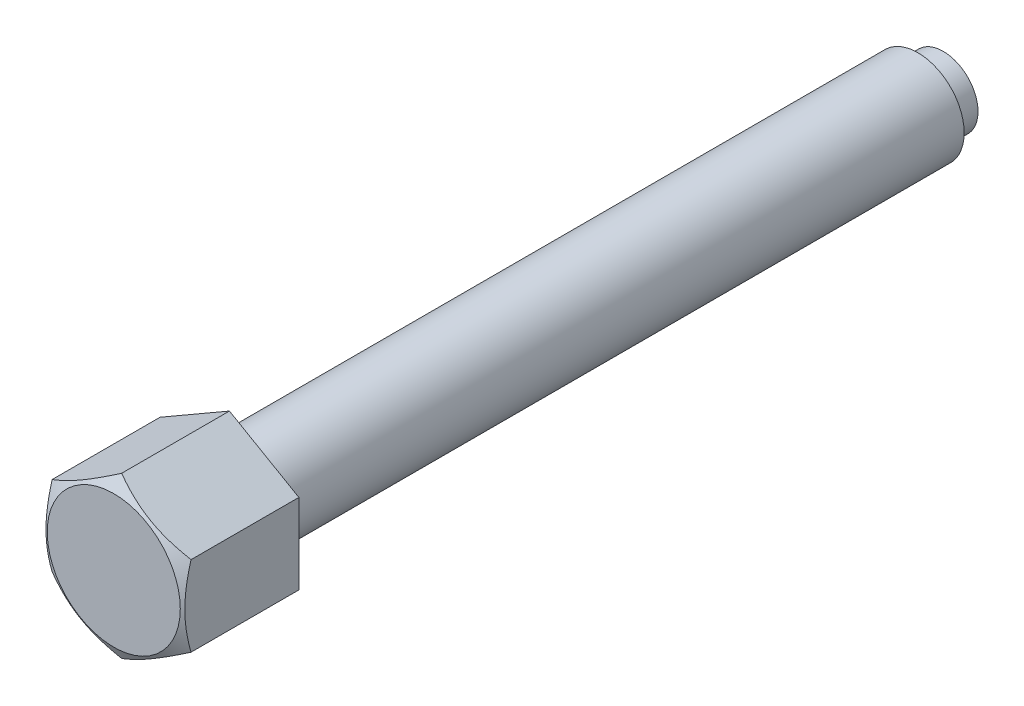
ISO-10303-21;
HEADER;
FILE_DESCRIPTION(('STEP AP214'),'2;1');
FILE_NAME('part.step','',(''),(''),'','','');
FILE_SCHEMA(('AUTOMOTIVE_DESIGN { 1 0 10303 214 1 1 1 1 }'));
ENDSEC;
DATA;
#1=APPLICATION_CONTEXT('core data for automotive mechanical design processes');
#2=APPLICATION_PROTOCOL_DEFINITION('international standard','automotive_design',2000,#1);
#3=PRODUCT_CONTEXT('',#1,'mechanical');
#4=PRODUCT('Part','Part','',(#3));
#5=PRODUCT_RELATED_PRODUCT_CATEGORY('part','',(#4));
#6=PRODUCT_DEFINITION_FORMATION('','',#4);
#7=PRODUCT_DEFINITION_CONTEXT('part definition',#1,'design');
#8=PRODUCT_DEFINITION('design','',#6,#7);
#9=PRODUCT_DEFINITION_SHAPE('','',#8);
#10=(LENGTH_UNIT() NAMED_UNIT(*) SI_UNIT(.MILLI.,.METRE.));
#11=(NAMED_UNIT(*) PLANE_ANGLE_UNIT() SI_UNIT($,.RADIAN.));
#12=(NAMED_UNIT(*) SI_UNIT($,.STERADIAN.) SOLID_ANGLE_UNIT());
#13=UNCERTAINTY_MEASURE_WITH_UNIT(LENGTH_MEASURE(1.E-05),#10,'distance_accuracy_value','');
#14=(GEOMETRIC_REPRESENTATION_CONTEXT(3) GLOBAL_UNCERTAINTY_ASSIGNED_CONTEXT((#13)) GLOBAL_UNIT_ASSIGNED_CONTEXT((#10,
#11,#12)) REPRESENTATION_CONTEXT('',''));
#15=CARTESIAN_POINT('',(0.,0.,0.));
#16=DIRECTION('',(0.,0.,1.));
#17=DIRECTION('',(1.,0.,0.));
#18=AXIS2_PLACEMENT_3D('',#15,#16,#17);
#19=CARTESIAN_POINT('',(0.,13.856406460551,125.));
#20=DIRECTION('',(-0.5,-0.86602540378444,0.));
#21=DIRECTION('',(0.86602540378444,-0.5,0.));
#22=AXIS2_PLACEMENT_3D('',#19,#20,#21);
#23=PLANE('',#22);
#24=CARTESIAN_POINT('',(12.0002,6.92808776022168,143.639461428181));
#25=CARTESIAN_POINT('',(11.7364142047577,7.08038456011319,143.727375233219));
#26=CARTESIAN_POINT('',(11.4716448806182,7.23324920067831,143.811298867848));
#27=CARTESIAN_POINT('',(10.9399829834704,7.54020434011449,143.970058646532));
#28=CARTESIAN_POINT('',(10.6730897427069,7.69429522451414,144.044891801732));
#29=CARTESIAN_POINT('',(9.86810959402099,8.15905073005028,144.254307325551));
#30=CARTESIAN_POINT('',(9.3268449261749,8.47155003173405,144.373421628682));
#31=CARTESIAN_POINT('',(8.51686717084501,8.93919090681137,144.513093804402));
#32=CARTESIAN_POINT('',(8.25057389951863,9.09293539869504,144.552881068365));
#33=CARTESIAN_POINT('',(7.71675440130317,9.40113622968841,144.619601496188));
#34=CARTESIAN_POINT('',(7.44922815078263,9.55559258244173,144.646534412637));
#35=CARTESIAN_POINT('',(6.91372963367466,9.86476279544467,144.686856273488));
#36=CARTESIAN_POINT('',(6.64575827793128,10.0194761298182,144.700261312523));
#37=CARTESIAN_POINT('',(6.10956726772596,10.3290461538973,144.713241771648));
#38=CARTESIAN_POINT('',(5.84134762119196,10.4839028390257,144.712817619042));
#39=CARTESIAN_POINT('',(5.33991062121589,10.7734076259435,144.699104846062));
#40=CARTESIAN_POINT('',(5.10665750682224,10.908076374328,144.687488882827));
#41=CARTESIAN_POINT('',(4.64068775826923,11.1771041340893,144.654016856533));
#42=CARTESIAN_POINT('',(4.40797116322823,11.3114631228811,144.632160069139));
#43=CARTESIAN_POINT('',(3.94320092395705,11.5797983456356,144.578587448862));
#44=CARTESIAN_POINT('',(3.711147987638,11.7137741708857,144.546863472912));
#45=CARTESIAN_POINT('',(3.24813003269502,11.9810977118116,144.474113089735));
#46=CARTESIAN_POINT('',(3.01716508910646,12.1144453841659,144.433086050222));
#47=CARTESIAN_POINT('',(2.31605804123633,12.5192297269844,144.295013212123));
#48=CARTESIAN_POINT('',(1.84794625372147,12.789494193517,144.184199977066));
#49=CARTESIAN_POINT('',(0.918702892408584,13.3259930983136,143.932699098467));
#50=CARTESIAN_POINT('',(0.457559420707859,13.5922344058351,143.792070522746));
#51=CARTESIAN_POINT('',(-0.000199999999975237,13.8565219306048,143.639461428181));
#52=B_SPLINE_CURVE_WITH_KNOTS('',3,(#24,#25,#26,#27,#28,#29,#30,#31,#32,#33,#34,#35,#36,#37,#38,
#39,#40,#41,#42,#43,#44,#45,#46,#47,#48,#49,#50,#51),.UNSPECIFIED.,.F.,.F.,(4,2,2,2,2,2,2,2,2,2,
2,2,2,4),(0.,0.951004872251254,1.90232158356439,3.8090046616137,4.73894551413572,
5.6689042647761,6.59775529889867,7.52657763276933,8.33514643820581,9.14377244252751,
9.95306755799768,10.7624176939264,12.4167102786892,14.0677556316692),.UNSPECIFIED.);
#53=CARTESIAN_POINT('',(12.,6.92820323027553,143.639528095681));
#54=VERTEX_POINT('',#53);
#55=CARTESIAN_POINT('',(0.,13.856406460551,143.639528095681));
#56=VERTEX_POINT('',#55);
#57=EDGE_CURVE('E29',#54,#56,#52,.T.);
#58=ORIENTED_EDGE('',*,*,#57,.F.);
#59=DIRECTION('',(0.,0.,1.));
#60=VECTOR('',#59,1.);
#61=CARTESIAN_POINT('',(12.,6.92820323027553,125.));
#62=LINE('',#61,#60);
#63=CARTESIAN_POINT('',(12.,6.92820323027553,125.));
#64=VERTEX_POINT('',#63);
#65=EDGE_CURVE('E99',#64,#54,#62,.T.);
#66=ORIENTED_EDGE('',*,*,#65,.F.);
#67=DIRECTION('',(0.86602540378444,-0.5,0.));
#68=VECTOR('',#67,1.);
#69=CARTESIAN_POINT('',(0.,13.856406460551,125.));
#70=LINE('',#69,#68);
#71=CARTESIAN_POINT('',(0.,13.856406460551,125.));
#72=VERTEX_POINT('',#71);
#73=EDGE_CURVE('E37',#72,#64,#70,.T.);
#74=ORIENTED_EDGE('',*,*,#73,.F.);
#75=DIRECTION('',(0.,0.,1.));
#76=VECTOR('',#75,1.);
#77=CARTESIAN_POINT('',(0.,13.856406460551,125.));
#78=LINE('',#77,#76);
#79=EDGE_CURVE('E87',#72,#56,#78,.T.);
#80=ORIENTED_EDGE('',*,*,#79,.T.);
#81=EDGE_LOOP('',(#58,#66,#74,#80));
#82=FACE_BOUND('',#81,.T.);
#83=ADVANCED_FACE('F14',(#82),#23,.F.);
#84=CARTESIAN_POINT('',(12.,6.92820323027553,125.));
#85=DIRECTION('',(-1.,0.,0.));
#86=DIRECTION('',(0.,0.,1.));
#87=AXIS2_PLACEMENT_3D('',#84,#85,#86);
#88=PLANE('',#87);
#89=CARTESIAN_POINT('',(12.,-18.6520842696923,138.834577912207));
#90=CARTESIAN_POINT('',(12.,-18.3898551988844,138.961899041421));
#91=CARTESIAN_POINT('',(12.,-18.1273195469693,139.088588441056));
#92=CARTESIAN_POINT('',(12.,-17.6015711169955,139.340560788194));
#93=CARTESIAN_POINT('',(12.,-17.3383583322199,139.465843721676));
#94=CARTESIAN_POINT('',(12.,-16.5475388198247,139.839401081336));
#95=CARTESIAN_POINT('',(12.,-16.0188278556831,140.085346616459));
#96=CARTESIAN_POINT('',(12.,-14.9550247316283,140.570863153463));
#97=CARTESIAN_POINT('',(12.,-14.4199135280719,140.810392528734));
#98=CARTESIAN_POINT('',(12.,-13.3454502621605,141.279708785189));
#99=CARTESIAN_POINT('',(12.,-12.8060984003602,141.509496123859));
#100=CARTESIAN_POINT('',(12.,-11.7047322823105,141.96399971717));
#101=CARTESIAN_POINT('',(12.,-11.1425498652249,142.18831059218));
#102=CARTESIAN_POINT('',(12.,-10.0116194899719,142.620058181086));
#103=CARTESIAN_POINT('',(12.,-9.44287080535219,142.827493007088));
#104=CARTESIAN_POINT('',(12.,-8.29897246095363,143.220070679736));
#105=CARTESIAN_POINT('',(12.,-7.72383828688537,143.405258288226));
#106=CARTESIAN_POINT('',(12.,-6.56526555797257,143.747437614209));
#107=CARTESIAN_POINT('',(12.,-5.98182966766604,143.904438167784));
#108=CARTESIAN_POINT('',(12.,-5.10195783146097,144.112709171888));
#109=CARTESIAN_POINT('',(12.,-4.80869223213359,144.177453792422));
#110=CARTESIAN_POINT('',(12.,-4.22014933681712,144.297098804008));
#111=CARTESIAN_POINT('',(12.,-3.92487208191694,144.351999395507));
#112=CARTESIAN_POINT('',(12.,-3.3325064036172,144.450989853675));
#113=CARTESIAN_POINT('',(12.,-3.03541800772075,144.495079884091));
#114=CARTESIAN_POINT('',(12.,-2.43974144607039,144.571571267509));
#115=CARTESIAN_POINT('',(12.,-2.14115333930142,144.603973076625));
#116=CARTESIAN_POINT('',(12.,-1.54681202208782,144.656035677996));
#117=CARTESIAN_POINT('',(12.,-1.25107306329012,144.675858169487));
#118=CARTESIAN_POINT('',(12.,-0.659022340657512,144.702976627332));
#119=CARTESIAN_POINT('',(12.,-0.362710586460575,144.71027280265));
#120=CARTESIAN_POINT('',(12.,0.229956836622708,144.712164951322));
#121=CARTESIAN_POINT('',(12.,0.526312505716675,144.706760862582));
#122=CARTESIAN_POINT('',(12.,1.11853118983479,144.683384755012));
#123=CARTESIAN_POINT('',(12.,1.41439418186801,144.66541216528));
#124=CARTESIAN_POINT('',(12.,2.12415362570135,144.6076032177));
#125=CARTESIAN_POINT('',(12.,2.53757874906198,144.561875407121));
#126=CARTESIAN_POINT('',(12.,3.36139101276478,144.448358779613));
#127=CARTESIAN_POINT('',(12.,3.77177773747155,144.380566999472));
#128=CARTESIAN_POINT('',(12.,4.58911091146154,144.225333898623));
#129=CARTESIAN_POINT('',(12.,4.99605445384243,144.137877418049));
#130=CARTESIAN_POINT('',(12.,5.80587435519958,143.945985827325));
#131=CARTESIAN_POINT('',(12.,6.20875077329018,143.84155096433));
#132=CARTESIAN_POINT('',(12.,7.0193598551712,143.615760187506));
#133=CARTESIAN_POINT('',(12.,7.42700152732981,143.494079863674));
#134=CARTESIAN_POINT('',(12.,8.23826948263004,143.238066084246));
#135=CARTESIAN_POINT('',(12.,8.64189573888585,143.103732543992));
#136=CARTESIAN_POINT('',(12.,9.4453313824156,142.824552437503));
#137=CARTESIAN_POINT('',(12.,9.84514196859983,142.679709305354));
#138=CARTESIAN_POINT('',(12.,10.641444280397,142.381222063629));
#139=CARTESIAN_POINT('',(12.,11.0379360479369,142.227578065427));
#140=CARTESIAN_POINT('',(12.,11.9857392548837,141.85012020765));
#141=CARTESIAN_POINT('',(12.,12.5356470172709,141.622786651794));
#142=CARTESIAN_POINT('',(12.,13.6306874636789,141.156862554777));
#143=CARTESIAN_POINT('',(12.,14.1758198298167,140.918271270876));
#144=CARTESIAN_POINT('',(12.,15.2622189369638,140.432126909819));
#145=CARTESIAN_POINT('',(12.,15.8034847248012,140.184571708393));
#146=CARTESIAN_POINT('',(12.,16.8826792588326,139.682341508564));
#147=CARTESIAN_POINT('',(12.,17.4206080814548,139.427666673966));
#148=CARTESIAN_POINT('',(12.,18.4943077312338,138.912255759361));
#149=CARTESIAN_POINT('',(12.,19.030075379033,138.651513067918));
#150=CARTESIAN_POINT('',(12.,20.0992834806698,138.125299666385));
#151=CARTESIAN_POINT('',(12.,20.6327239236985,137.859828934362));
#152=CARTESIAN_POINT('',(12.,21.6975680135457,137.325018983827));
#153=CARTESIAN_POINT('',(12.,22.2289719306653,137.055680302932));
#154=CARTESIAN_POINT('',(12.,23.2901146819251,136.513740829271));
#155=CARTESIAN_POINT('',(12.,23.8198535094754,136.241140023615));
#156=CARTESIAN_POINT('',(12.,25.3159236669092,135.466375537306));
#157=CARTESIAN_POINT('',(12.,26.2805978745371,134.961012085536));
#158=CARTESIAN_POINT('',(12.,28.2063891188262,133.943481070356));
#159=CARTESIAN_POINT('',(12.,29.1675060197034,133.431313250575));
#160=CARTESIAN_POINT('',(12.,31.0844738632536,132.403112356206));
#161=CARTESIAN_POINT('',(12.,32.0403319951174,131.887092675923));
#162=CARTESIAN_POINT('',(12.,33.472447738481,131.11005108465));
#163=CARTESIAN_POINT('',(12.,33.9495276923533,130.850542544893));
#164=CARTESIAN_POINT('',(12.,34.9031943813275,130.330622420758));
#165=CARTESIAN_POINT('',(12.,35.3797811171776,130.070210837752));
#166=CARTESIAN_POINT('',(12.,35.8561494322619,129.809400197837));
#167=B_SPLINE_CURVE_WITH_KNOTS('',3,(#89,#90,#91,#92,#93,#94,#95,#96,#97,#98,#99,#100,#101,#102,
#103,#104,#105,#106,#107,#108,#109,#110,#111,#112,#113,#114,#115,#116,#117,#118,#119,#120,#121,
#122,#123,#124,#125,#126,#127,#128,#129,#130,#131,#132,#133,#134,#135,#136,#137,#138,#139,#140,
#141,#142,#143,#144,#145,#146,#147,#148,#149,#150,#151,#152,#153,#154,#155,#156,#157,#158,#159,
#160,#161,#162,#163,#164,#165,#166),.UNSPECIFIED.,.F.,.F.,(4,2,2,2,2,2,2,2,2,2,2,2,2,2,2,2,2,2,
2,2,2,2,2,2,2,2,2,2,2,2,2,2,2,2,2,2,2,2,4),(0.,0.874511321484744,1.74903135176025,
3.49832805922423,5.2570772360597,7.0157437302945,8.83137823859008,10.6472155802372,
12.4593359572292,14.2708872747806,15.1717311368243,16.072556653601,16.9733685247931,
17.874145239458,18.7630950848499,19.6520301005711,20.5409694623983,21.4299492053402,
22.6770991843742,23.9244167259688,25.1726991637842,26.4209634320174,27.6969627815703,
28.9729706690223,30.2485634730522,31.5241401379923,33.3091044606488,35.0941867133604,
36.8796947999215,38.6651618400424,40.4526749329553,42.2401963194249,44.0274716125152,
45.814753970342,49.0818057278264,52.3489809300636,55.6077204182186,57.2369985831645,
58.8662742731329),.UNSPECIFIED.);
#168=CARTESIAN_POINT('',(12.,-6.92820323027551,143.639528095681));
#169=VERTEX_POINT('',#168);
#170=EDGE_CURVE('E146',#169,#54,#167,.T.);
#171=ORIENTED_EDGE('',*,*,#170,.F.);
#172=DIRECTION('',(0.,0.,1.));
#173=VECTOR('',#172,1.);
#174=CARTESIAN_POINT('',(12.,-6.9282032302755,125.));
#175=LINE('',#174,#173);
#176=CARTESIAN_POINT('',(12.,-6.9282032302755,125.));
#177=VERTEX_POINT('',#176);
#178=EDGE_CURVE('E96',#177,#169,#175,.T.);
#179=ORIENTED_EDGE('',*,*,#178,.F.);
#180=DIRECTION('',(0.,-1.,0.));
#181=VECTOR('',#180,1.);
#182=CARTESIAN_POINT('',(12.,6.92820323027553,125.));
#183=LINE('',#182,#181);
#184=EDGE_CURVE('E161',#64,#177,#183,.T.);
#185=ORIENTED_EDGE('',*,*,#184,.F.);
#186=ORIENTED_EDGE('',*,*,#65,.T.);
#187=EDGE_LOOP('',(#171,#179,#185,#186));
#188=FACE_BOUND('',#187,.T.);
#189=ADVANCED_FACE('F125',(#188),#88,.F.);
#190=CARTESIAN_POINT('',(0.,-13.856406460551,125.));
#191=DIRECTION('',(0.5,-0.866025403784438,0.));
#192=DIRECTION('',(0.866025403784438,0.5,0.));
#193=AXIS2_PLACEMENT_3D('',#190,#191,#192);
#194=PLANE('',#193);
#195=ORIENTED_EDGE('',*,*,#178,.T.);
#196=CARTESIAN_POINT('',(12.0002,-6.92808776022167,143.639461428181));
#197=CARTESIAN_POINT('',(11.7364142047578,-7.08038456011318,143.727375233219));
#198=CARTESIAN_POINT('',(11.4716448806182,-7.2332492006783,143.811298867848));
#199=CARTESIAN_POINT('',(10.9399829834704,-7.54020434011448,143.970058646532));
#200=CARTESIAN_POINT('',(10.6730897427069,-7.69429522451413,144.044891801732));
#201=CARTESIAN_POINT('',(9.86810959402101,-8.15905073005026,144.254307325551));
#202=CARTESIAN_POINT('',(9.32684492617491,-8.47155003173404,144.373421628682));
#203=CARTESIAN_POINT('',(8.51686717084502,-8.93919090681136,144.513093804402));
#204=CARTESIAN_POINT('',(8.25057389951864,-9.09293539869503,144.552881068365));
#205=CARTESIAN_POINT('',(7.71675440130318,-9.4011362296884,144.619601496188));
#206=CARTESIAN_POINT('',(7.44922815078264,-9.55559258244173,144.646534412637));
#207=CARTESIAN_POINT('',(6.91372963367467,-9.86476279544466,144.686856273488));
#208=CARTESIAN_POINT('',(6.64575827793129,-10.0194761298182,144.700261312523));
#209=CARTESIAN_POINT('',(6.10956726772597,-10.3290461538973,144.713241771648));
#210=CARTESIAN_POINT('',(5.84134762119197,-10.4839028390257,144.712817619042));
#211=CARTESIAN_POINT('',(5.3399106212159,-10.7734076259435,144.699104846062));
#212=CARTESIAN_POINT('',(5.10665750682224,-10.908076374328,144.687488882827));
#213=CARTESIAN_POINT('',(4.64068775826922,-11.1771041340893,144.654016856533));
#214=CARTESIAN_POINT('',(4.40797116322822,-11.3114631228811,144.632160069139));
#215=CARTESIAN_POINT('',(3.94320092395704,-11.5797983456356,144.578587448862));
#216=CARTESIAN_POINT('',(3.71114798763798,-11.7137741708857,144.546863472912));
#217=CARTESIAN_POINT('',(3.248130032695,-11.9810977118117,144.474113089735));
#218=CARTESIAN_POINT('',(3.01716508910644,-12.1144453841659,144.433086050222));
#219=CARTESIAN_POINT('',(2.31605804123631,-12.5192297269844,144.295013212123));
#220=CARTESIAN_POINT('',(1.84794625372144,-12.789494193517,144.184199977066));
#221=CARTESIAN_POINT('',(0.91870289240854,-13.3259930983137,143.932699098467));
#222=CARTESIAN_POINT('',(0.457559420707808,-13.5922344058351,143.792070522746));
#223=CARTESIAN_POINT('',(-0.000200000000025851,-13.8565219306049,143.639461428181));
#224=B_SPLINE_CURVE_WITH_KNOTS('',3,(#196,#197,#198,#199,#200,#201,#202,#203,#204,#205,#206,
#207,#208,#209,#210,#211,#212,#213,#214,#215,#216,#217,#218,#219,#220,#221,#222,#223),
.UNSPECIFIED.,.F.,.F.,(4,2,2,2,2,2,2,2,2,2,2,2,2,4),(0.,0.951004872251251,1.90232158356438,
3.8090046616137,4.73894551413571,5.6689042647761,6.59775529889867,7.52657763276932,
8.33514643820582,9.14377244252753,9.9530675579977,10.7624176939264,12.4167102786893,
14.0677556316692),.UNSPECIFIED.);
#225=CARTESIAN_POINT('',(0.,-13.856406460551,143.639528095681));
#226=VERTEX_POINT('',#225);
#227=EDGE_CURVE('E172',#169,#226,#224,.T.);
#228=ORIENTED_EDGE('',*,*,#227,.T.);
#229=DIRECTION('',(0.,0.,1.));
#230=VECTOR('',#229,1.);
#231=CARTESIAN_POINT('',(0.,-13.856406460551,125.));
#232=LINE('',#231,#230);
#233=CARTESIAN_POINT('',(0.,-13.856406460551,125.));
#234=VERTEX_POINT('',#233);
#235=EDGE_CURVE('E89',#234,#226,#232,.T.);
#236=ORIENTED_EDGE('',*,*,#235,.F.);
#237=DIRECTION('',(0.866025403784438,0.5,0.));
#238=VECTOR('',#237,1.);
#239=CARTESIAN_POINT('',(0.,-13.856406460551,125.));
#240=LINE('',#239,#238);
#241=EDGE_CURVE('E158',#234,#177,#240,.T.);
#242=ORIENTED_EDGE('',*,*,#241,.T.);
#243=EDGE_LOOP('',(#195,#228,#236,#242));
#244=FACE_BOUND('',#243,.T.);
#245=ADVANCED_FACE('F130',(#244),#194,.T.);
#246=CARTESIAN_POINT('',(0.,-13.856406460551,125.));
#247=DIRECTION('',(0.5,0.866025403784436,0.));
#248=DIRECTION('',(-0.866025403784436,0.5,0.));
#249=AXIS2_PLACEMENT_3D('',#246,#247,#248);
#250=PLANE('',#249);
#251=CARTESIAN_POINT('',(-12.0002,-6.92808776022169,143.639461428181));
#252=CARTESIAN_POINT('',(-11.7364142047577,-7.0803845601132,143.727375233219));
#253=CARTESIAN_POINT('',(-11.4716448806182,-7.23324920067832,143.811298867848));
#254=CARTESIAN_POINT('',(-10.9399829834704,-7.5402043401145,143.970058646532));
#255=CARTESIAN_POINT('',(-10.6730897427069,-7.69429522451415,144.044891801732));
#256=CARTESIAN_POINT('',(-9.868109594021,-8.15905073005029,144.254307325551));
#257=CARTESIAN_POINT('',(-9.32684492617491,-8.47155003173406,144.373421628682));
#258=CARTESIAN_POINT('',(-8.51686717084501,-8.93919090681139,144.513093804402));
#259=CARTESIAN_POINT('',(-8.25057389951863,-9.09293539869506,144.552881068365));
#260=CARTESIAN_POINT('',(-7.71675440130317,-9.40113622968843,144.619601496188));
#261=CARTESIAN_POINT('',(-7.44922815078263,-9.55559258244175,144.646534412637));
#262=CARTESIAN_POINT('',(-6.91372963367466,-9.86476279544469,144.686856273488));
#263=CARTESIAN_POINT('',(-6.64575827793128,-10.0194761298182,144.700261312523));
#264=CARTESIAN_POINT('',(-6.10956726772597,-10.3290461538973,144.713241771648));
#265=CARTESIAN_POINT('',(-5.84134762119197,-10.4839028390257,144.712817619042));
#266=CARTESIAN_POINT('',(-5.3399106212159,-10.7734076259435,144.699104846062));
#267=CARTESIAN_POINT('',(-5.10665750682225,-10.908076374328,144.687488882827));
#268=CARTESIAN_POINT('',(-4.64068775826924,-11.1771041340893,144.654016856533));
#269=CARTESIAN_POINT('',(-4.40797116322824,-11.3114631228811,144.632160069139));
#270=CARTESIAN_POINT('',(-3.94320092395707,-11.5797983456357,144.578587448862));
#271=CARTESIAN_POINT('',(-3.71114798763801,-11.7137741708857,144.546863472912));
#272=CARTESIAN_POINT('',(-3.24813003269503,-11.9810977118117,144.474113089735));
#273=CARTESIAN_POINT('',(-3.01716508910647,-12.1144453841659,144.433086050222));
#274=CARTESIAN_POINT('',(-2.31605804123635,-12.5192297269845,144.295013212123));
#275=CARTESIAN_POINT('',(-1.84794625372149,-12.789494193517,144.184199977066));
#276=CARTESIAN_POINT('',(-0.918702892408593,-13.3259930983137,143.932699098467));
#277=CARTESIAN_POINT('',(-0.457559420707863,-13.5922344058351,143.792070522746));
#278=CARTESIAN_POINT('',(0.00019999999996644,-13.8565219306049,143.639461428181));
#279=B_SPLINE_CURVE_WITH_KNOTS('',3,(#251,#252,#253,#254,#255,#256,#257,#258,#259,#260,#261,
#262,#263,#264,#265,#266,#267,#268,#269,#270,#271,#272,#273,#274,#275,#276,#277,#278),
.UNSPECIFIED.,.F.,.F.,(4,2,2,2,2,2,2,2,2,2,2,2,2,4),(0.,0.951004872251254,1.90232158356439,
3.8090046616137,4.73894551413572,5.66890426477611,6.59775529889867,7.52657763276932,
8.33514643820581,9.14377244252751,9.95306755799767,10.7624176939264,12.4167102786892,
14.0677556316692),.UNSPECIFIED.);
#280=CARTESIAN_POINT('',(-12.,-6.92820323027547,143.639528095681));
#281=VERTEX_POINT('',#280);
#282=EDGE_CURVE('E81',#281,#226,#279,.T.);
#283=ORIENTED_EDGE('',*,*,#282,.F.);
#284=DIRECTION('',(0.,0.,1.));
#285=VECTOR('',#284,1.);
#286=CARTESIAN_POINT('',(-12.,-6.92820323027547,125.));
#287=LINE('',#286,#285);
#288=CARTESIAN_POINT('',(-12.,-6.92820323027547,125.));
#289=VERTEX_POINT('',#288);
#290=EDGE_CURVE('E80',#289,#281,#287,.T.);
#291=ORIENTED_EDGE('',*,*,#290,.F.);
#292=DIRECTION('',(-0.866025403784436,0.5,0.));
#293=VECTOR('',#292,1.);
#294=CARTESIAN_POINT('',(0.,-13.856406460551,125.));
#295=LINE('',#294,#293);
#296=EDGE_CURVE('E155',#234,#289,#295,.T.);
#297=ORIENTED_EDGE('',*,*,#296,.F.);
#298=ORIENTED_EDGE('',*,*,#235,.T.);
#299=EDGE_LOOP('',(#283,#291,#297,#298));
#300=FACE_BOUND('',#299,.T.);
#301=ADVANCED_FACE('F170',(#300),#250,.F.);
#302=CARTESIAN_POINT('',(-12.,6.92820323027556,125.));
#303=DIRECTION('',(-1.,0.,0.));
#304=DIRECTION('',(0.,0.,1.));
#305=AXIS2_PLACEMENT_3D('',#302,#303,#304);
#306=PLANE('',#305);
#307=ORIENTED_EDGE('',*,*,#290,.T.);
#308=CARTESIAN_POINT('',(-12.,-18.6520842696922,138.834577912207));
#309=CARTESIAN_POINT('',(-12.,-18.3898551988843,138.961899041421));
#310=CARTESIAN_POINT('',(-12.,-18.1273195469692,139.088588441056));
#311=CARTESIAN_POINT('',(-12.,-17.6015711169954,139.340560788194));
#312=CARTESIAN_POINT('',(-12.,-17.3383583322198,139.465843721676));
#313=CARTESIAN_POINT('',(-12.,-16.5475388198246,139.839401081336));
#314=CARTESIAN_POINT('',(-12.,-16.0188278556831,140.085346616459));
#315=CARTESIAN_POINT('',(-12.,-14.9550247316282,140.570863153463));
#316=CARTESIAN_POINT('',(-12.,-14.4199135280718,140.810392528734));
#317=CARTESIAN_POINT('',(-12.,-13.3454502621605,141.279708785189));
#318=CARTESIAN_POINT('',(-12.,-12.8060984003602,141.509496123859));
#319=CARTESIAN_POINT('',(-12.,-11.7047322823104,141.96399971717));
#320=CARTESIAN_POINT('',(-12.,-11.1425498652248,142.18831059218));
#321=CARTESIAN_POINT('',(-12.,-10.0116194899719,142.620058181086));
#322=CARTESIAN_POINT('',(-12.,-9.44287080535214,142.827493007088));
#323=CARTESIAN_POINT('',(-12.,-8.29897246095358,143.220070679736));
#324=CARTESIAN_POINT('',(-12.,-7.72383828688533,143.405258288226));
#325=CARTESIAN_POINT('',(-12.,-6.56526555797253,143.747437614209));
#326=CARTESIAN_POINT('',(-12.,-5.981829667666,143.904438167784));
#327=CARTESIAN_POINT('',(-12.,-5.10195783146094,144.112709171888));
#328=CARTESIAN_POINT('',(-12.,-4.80869223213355,144.177453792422));
#329=CARTESIAN_POINT('',(-12.,-4.22014933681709,144.297098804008));
#330=CARTESIAN_POINT('',(-12.,-3.92487208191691,144.351999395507));
#331=CARTESIAN_POINT('',(-12.,-3.33250640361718,144.450989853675));
#332=CARTESIAN_POINT('',(-12.,-3.03541800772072,144.495079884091));
#333=CARTESIAN_POINT('',(-12.,-2.43974144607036,144.571571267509));
#334=CARTESIAN_POINT('',(-12.,-2.14115333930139,144.603973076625));
#335=CARTESIAN_POINT('',(-12.,-1.54681202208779,144.656035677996));
#336=CARTESIAN_POINT('',(-12.,-1.2510730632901,144.675858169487));
#337=CARTESIAN_POINT('',(-12.,-0.659022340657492,144.702976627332));
#338=CARTESIAN_POINT('',(-12.,-0.362710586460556,144.71027280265));
#339=CARTESIAN_POINT('',(-12.,0.229956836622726,144.712164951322));
#340=CARTESIAN_POINT('',(-12.,0.526312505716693,144.706760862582));
#341=CARTESIAN_POINT('',(-12.,1.11853118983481,144.683384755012));
#342=CARTESIAN_POINT('',(-12.,1.41439418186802,144.66541216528));
#343=CARTESIAN_POINT('',(-12.,2.12415362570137,144.6076032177));
#344=CARTESIAN_POINT('',(-12.,2.53757874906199,144.561875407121));
#345=CARTESIAN_POINT('',(-12.,3.3613910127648,144.448358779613));
#346=CARTESIAN_POINT('',(-12.,3.77177773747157,144.380566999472));
#347=CARTESIAN_POINT('',(-12.,4.58911091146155,144.225333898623));
#348=CARTESIAN_POINT('',(-12.,4.99605445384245,144.137877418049));
#349=CARTESIAN_POINT('',(-12.,5.8058743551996,143.945985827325));
#350=CARTESIAN_POINT('',(-12.,6.2087507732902,143.84155096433));
#351=CARTESIAN_POINT('',(-12.,7.01935985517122,143.615760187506));
#352=CARTESIAN_POINT('',(-12.,7.42700152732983,143.494079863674));
#353=CARTESIAN_POINT('',(-12.,8.23826948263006,143.238066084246));
#354=CARTESIAN_POINT('',(-12.,8.64189573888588,143.103732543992));
#355=CARTESIAN_POINT('',(-12.,9.44533138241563,142.824552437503));
#356=CARTESIAN_POINT('',(-12.,9.84514196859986,142.679709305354));
#357=CARTESIAN_POINT('',(-12.,10.641444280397,142.381222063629));
#358=CARTESIAN_POINT('',(-12.,11.037936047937,142.227578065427));
#359=CARTESIAN_POINT('',(-12.,11.9857392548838,141.85012020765));
#360=CARTESIAN_POINT('',(-12.,12.535647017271,141.622786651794));
#361=CARTESIAN_POINT('',(-12.,13.6306874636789,141.156862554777));
#362=CARTESIAN_POINT('',(-12.,14.1758198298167,140.918271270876));
#363=CARTESIAN_POINT('',(-12.,15.2622189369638,140.432126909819));
#364=CARTESIAN_POINT('',(-12.,15.8034847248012,140.184571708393));
#365=CARTESIAN_POINT('',(-12.,16.8826792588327,139.682341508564));
#366=CARTESIAN_POINT('',(-12.,17.4206080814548,139.427666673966));
#367=CARTESIAN_POINT('',(-12.,18.4943077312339,138.912255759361));
#368=CARTESIAN_POINT('',(-12.,19.030075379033,138.651513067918));
#369=CARTESIAN_POINT('',(-12.,20.0992834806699,138.125299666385));
#370=CARTESIAN_POINT('',(-12.,20.6327239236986,137.859828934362));
#371=CARTESIAN_POINT('',(-12.,21.6975680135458,137.325018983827));
#372=CARTESIAN_POINT('',(-12.,22.2289719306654,137.055680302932));
#373=CARTESIAN_POINT('',(-12.,23.2901146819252,136.513740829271));
#374=CARTESIAN_POINT('',(-12.,23.8198535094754,136.241140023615));
#375=CARTESIAN_POINT('',(-12.,25.3159236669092,135.466375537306));
#376=CARTESIAN_POINT('',(-12.,26.2805978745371,134.961012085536));
#377=CARTESIAN_POINT('',(-12.,28.2063891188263,133.943481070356));
#378=CARTESIAN_POINT('',(-12.,29.1675060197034,133.431313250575));
#379=CARTESIAN_POINT('',(-12.,31.0844738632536,132.403112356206));
#380=CARTESIAN_POINT('',(-12.,32.0403319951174,131.887092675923));
#381=CARTESIAN_POINT('',(-12.,33.4724477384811,131.11005108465));
#382=CARTESIAN_POINT('',(-12.,33.9495276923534,130.850542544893));
#383=CARTESIAN_POINT('',(-12.,34.9031943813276,130.330622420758));
#384=CARTESIAN_POINT('',(-12.,35.3797811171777,130.070210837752));
#385=CARTESIAN_POINT('',(-12.,35.856149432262,129.809400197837));
#386=B_SPLINE_CURVE_WITH_KNOTS('',3,(#308,#309,#310,#311,#312,#313,#314,#315,#316,#317,#318,
#319,#320,#321,#322,#323,#324,#325,#326,#327,#328,#329,#330,#331,#332,#333,#334,#335,#336,#337,
#338,#339,#340,#341,#342,#343,#344,#345,#346,#347,#348,#349,#350,#351,#352,#353,#354,#355,#356,
#357,#358,#359,#360,#361,#362,#363,#364,#365,#366,#367,#368,#369,#370,#371,#372,#373,#374,#375,
#376,#377,#378,#379,#380,#381,#382,#383,#384,#385),.UNSPECIFIED.,.F.,.F.,(4,2,2,2,2,2,2,2,2,2,2,
2,2,2,2,2,2,2,2,2,2,2,2,2,2,2,2,2,2,2,2,2,2,2,2,2,2,2,4),(0.,0.874511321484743,1.74903135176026,
3.49832805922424,5.25707723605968,7.01574373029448,8.83137823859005,10.6472155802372,
12.4593359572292,14.2708872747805,15.1717311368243,16.0725566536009,16.973368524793,
17.8741452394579,18.7630950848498,19.6520301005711,20.5409694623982,21.4299492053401,
22.6770991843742,23.9244167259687,25.1726991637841,26.4209634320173,27.6969627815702,
28.9729706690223,30.2485634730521,31.5241401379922,33.3091044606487,35.0941867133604,
36.8796947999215,38.6651618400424,40.4526749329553,42.2401963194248,44.0274716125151,
45.814753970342,49.0818057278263,52.3489809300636,55.6077204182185,57.2369985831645,
58.8662742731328),.UNSPECIFIED.);
#387=CARTESIAN_POINT('',(-12.,6.92820323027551,143.639528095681));
#388=VERTEX_POINT('',#387);
#389=EDGE_CURVE('E68',#281,#388,#386,.T.);
#390=ORIENTED_EDGE('',*,*,#389,.T.);
#391=DIRECTION('',(0.,0.,1.));
#392=VECTOR('',#391,1.);
#393=CARTESIAN_POINT('',(-12.,6.92820323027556,125.));
#394=LINE('',#393,#392);
#395=CARTESIAN_POINT('',(-12.,6.92820323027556,125.));
#396=VERTEX_POINT('',#395);
#397=EDGE_CURVE('E78',#396,#388,#394,.T.);
#398=ORIENTED_EDGE('',*,*,#397,.F.);
#399=DIRECTION('',(0.,-1.,0.));
#400=VECTOR('',#399,1.);
#401=CARTESIAN_POINT('',(-12.,6.92820323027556,125.));
#402=LINE('',#401,#400);
#403=EDGE_CURVE('E153',#396,#289,#402,.T.);
#404=ORIENTED_EDGE('',*,*,#403,.T.);
#405=EDGE_LOOP('',(#307,#390,#398,#404));
#406=FACE_BOUND('',#405,.T.);
#407=ADVANCED_FACE('F76',(#406),#306,.T.);
#408=CARTESIAN_POINT('',(0.,13.856406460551,125.));
#409=DIRECTION('',(-0.5,0.866025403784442,0.));
#410=DIRECTION('',(-0.866025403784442,-0.5,0.));
#411=AXIS2_PLACEMENT_3D('',#408,#409,#410);
#412=PLANE('',#411);
#413=ORIENTED_EDGE('',*,*,#397,.T.);
#414=CARTESIAN_POINT('',(-12.0002,6.92808776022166,143.639461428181));
#415=CARTESIAN_POINT('',(-11.7364142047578,7.08038456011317,143.727375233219));
#416=CARTESIAN_POINT('',(-11.4716448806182,7.23324920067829,143.811298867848));
#417=CARTESIAN_POINT('',(-10.9399829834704,7.54020434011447,143.970058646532));
#418=CARTESIAN_POINT('',(-10.6730897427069,7.69429522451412,144.044891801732));
#419=CARTESIAN_POINT('',(-9.868109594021,8.15905073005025,144.254307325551));
#420=CARTESIAN_POINT('',(-9.32684492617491,8.47155003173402,144.373421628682));
#421=CARTESIAN_POINT('',(-8.51686717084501,8.93919090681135,144.513093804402));
#422=CARTESIAN_POINT('',(-8.25057389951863,9.09293539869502,144.552881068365));
#423=CARTESIAN_POINT('',(-7.71675440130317,9.40113622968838,144.619601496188));
#424=CARTESIAN_POINT('',(-7.44922815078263,9.55559258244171,144.646534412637));
#425=CARTESIAN_POINT('',(-6.91372963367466,9.86476279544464,144.686856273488));
#426=CARTESIAN_POINT('',(-6.64575827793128,10.0194761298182,144.700261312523));
#427=CARTESIAN_POINT('',(-6.10956726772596,10.3290461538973,144.713241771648));
#428=CARTESIAN_POINT('',(-5.84134762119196,10.4839028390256,144.712817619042));
#429=CARTESIAN_POINT('',(-5.33991062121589,10.7734076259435,144.699104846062));
#430=CARTESIAN_POINT('',(-5.10665750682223,10.908076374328,144.687488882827));
#431=CARTESIAN_POINT('',(-4.64068775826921,11.1771041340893,144.654016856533));
#432=CARTESIAN_POINT('',(-4.40797116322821,11.3114631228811,144.632160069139));
#433=CARTESIAN_POINT('',(-3.94320092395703,11.5797983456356,144.578587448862));
#434=CARTESIAN_POINT('',(-3.71114798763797,11.7137741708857,144.546863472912));
#435=CARTESIAN_POINT('',(-3.24813003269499,11.9810977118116,144.474113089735));
#436=CARTESIAN_POINT('',(-3.01716508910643,12.1144453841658,144.433086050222));
#437=CARTESIAN_POINT('',(-2.3160580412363,12.5192297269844,144.295013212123));
#438=CARTESIAN_POINT('',(-1.84794625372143,12.789494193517,144.184199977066));
#439=CARTESIAN_POINT('',(-0.918702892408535,13.3259930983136,143.932699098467));
#440=CARTESIAN_POINT('',(-0.457559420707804,13.5922344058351,143.792070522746));
#441=CARTESIAN_POINT('',(0.00020000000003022,13.8565219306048,143.639461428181));
#442=B_SPLINE_CURVE_WITH_KNOTS('',3,(#414,#415,#416,#417,#418,#419,#420,#421,#422,#423,#424,
#425,#426,#427,#428,#429,#430,#431,#432,#433,#434,#435,#436,#437,#438,#439,#440,#441),
.UNSPECIFIED.,.F.,.F.,(4,2,2,2,2,2,2,2,2,2,2,2,2,4),(0.,0.951004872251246,1.90232158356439,
3.8090046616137,4.73894551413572,5.6689042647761,6.59775529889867,7.52657763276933,
8.33514643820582,9.14377244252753,9.9530675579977,10.7624176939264,12.4167102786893,
14.0677556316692),.UNSPECIFIED.);
#443=EDGE_CURVE('E65',#388,#56,#442,.T.);
#444=ORIENTED_EDGE('',*,*,#443,.T.);
#445=ORIENTED_EDGE('',*,*,#79,.F.);
#446=DIRECTION('',(-0.866025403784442,-0.5,0.));
#447=VECTOR('',#446,1.);
#448=CARTESIAN_POINT('',(0.,13.856406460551,125.));
#449=LINE('',#448,#447);
#450=EDGE_CURVE('E85',#72,#396,#449,.T.);
#451=ORIENTED_EDGE('',*,*,#450,.T.);
#452=EDGE_LOOP('',(#413,#444,#445,#451));
#453=FACE_BOUND('',#452,.T.);
#454=ADVANCED_FACE('F83',(#453),#412,.T.);
#455=CARTESIAN_POINT('',(0.,0.,12.));
#456=DIRECTION('',(0.,0.,1.));
#457=DIRECTION('',(1.,0.,0.));
#458=AXIS2_PLACEMENT_3D('',#455,#456,#457);
#459=SPHERICAL_SURFACE('',#458,12.);
#460=CARTESIAN_POINT('',(0.,0.,1.60769515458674));
#461=DIRECTION('',(0.,0.,1.));
#462=DIRECTION('',(1.,0.,0.));
#463=AXIS2_PLACEMENT_3D('',#460,#461,#462);
#464=CIRCLE('',#463,6.);
#465=CARTESIAN_POINT('',(6.,0.,1.60769515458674));
#466=VERTEX_POINT('',#465);
#467=EDGE_CURVE('E9',#466,#466,#464,.T.);
#468=ORIENTED_EDGE('',*,*,#467,.F.);
#469=EDGE_LOOP('',(#468));
#470=FACE_BOUND('',#469,.T.);
#471=ADVANCED_FACE('F16',(#470),#459,.T.);
#472=CARTESIAN_POINT('',(0.,0.,110.));
#473=DIRECTION('',(0.,0.,1.));
#474=DIRECTION('',(1.,0.,0.));
#475=AXIS2_PLACEMENT_3D('',#472,#473,#474);
#476=CYLINDRICAL_SURFACE('',#475,6.);
#477=ORIENTED_EDGE('',*,*,#467,.T.);
#478=EDGE_LOOP('',(#477));
#479=FACE_BOUND('',#478,.T.);
#480=CARTESIAN_POINT('',(0.,0.,6.));
#481=DIRECTION('',(0.,0.,1.));
#482=DIRECTION('',(1.,0.,0.));
#483=AXIS2_PLACEMENT_3D('',#480,#481,#482);
#484=CIRCLE('',#483,6.);
#485=CARTESIAN_POINT('',(6.,0.,6.));
#486=VERTEX_POINT('',#485);
#487=EDGE_CURVE('E22',#486,#486,#484,.T.);
#488=ORIENTED_EDGE('',*,*,#487,.F.);
#489=EDGE_LOOP('',(#488));
#490=FACE_BOUND('',#489,.T.);
#491=ADVANCED_FACE('F112',(#479,#490),#476,.T.);
#492=CARTESIAN_POINT('',(6.,0.,6.));
#493=DIRECTION('',(0.,0.,1.));
#494=DIRECTION('',(1.,0.,0.));
#495=AXIS2_PLACEMENT_3D('',#492,#493,#494);
#496=PLANE('',#495);
#497=CARTESIAN_POINT('',(0.,0.,6.));
#498=DIRECTION('',(0.,0.,1.));
#499=DIRECTION('',(1.,0.,0.));
#500=AXIS2_PLACEMENT_3D('',#497,#498,#499);
#501=CIRCLE('',#500,8.);
#502=CARTESIAN_POINT('',(8.,0.,6.));
#503=VERTEX_POINT('',#502);
#504=EDGE_CURVE('E105',#503,#503,#501,.T.);
#505=ORIENTED_EDGE('',*,*,#504,.F.);
#506=EDGE_LOOP('',(#505));
#507=FACE_BOUND('',#506,.T.);
#508=ORIENTED_EDGE('',*,*,#487,.T.);
#509=EDGE_LOOP('',(#508));
#510=FACE_BOUND('',#509,.T.);
#511=ADVANCED_FACE('F110',(#507,#510),#496,.F.);
#512=CARTESIAN_POINT('',(0.,0.,110.));
#513=DIRECTION('',(0.,0.,1.));
#514=DIRECTION('',(1.,0.,0.));
#515=AXIS2_PLACEMENT_3D('',#512,#513,#514);
#516=CYLINDRICAL_SURFACE('',#515,8.);
#517=CARTESIAN_POINT('',(0.,0.,125.));
#518=DIRECTION('',(0.,0.,1.));
#519=DIRECTION('',(1.,0.,0.));
#520=AXIS2_PLACEMENT_3D('',#517,#518,#519);
#521=CIRCLE('',#520,8.);
#522=CARTESIAN_POINT('',(8.,0.,125.));
#523=VERTEX_POINT('',#522);
#524=EDGE_CURVE('E102',#523,#523,#521,.T.);
#525=ORIENTED_EDGE('',*,*,#524,.F.);
#526=EDGE_LOOP('',(#525));
#527=FACE_BOUND('',#526,.T.);
#528=ORIENTED_EDGE('',*,*,#504,.T.);
#529=EDGE_LOOP('',(#528));
#530=FACE_BOUND('',#529,.T.);
#531=ADVANCED_FACE('F120',(#527,#530),#516,.T.);
#532=CARTESIAN_POINT('',(8.,0.,125.));
#533=DIRECTION('',(0.,0.,1.));
#534=DIRECTION('',(1.,0.,0.));
#535=AXIS2_PLACEMENT_3D('',#532,#533,#534);
#536=PLANE('',#535);
#537=ORIENTED_EDGE('',*,*,#450,.F.);
#538=ORIENTED_EDGE('',*,*,#73,.T.);
#539=ORIENTED_EDGE('',*,*,#184,.T.);
#540=ORIENTED_EDGE('',*,*,#241,.F.);
#541=ORIENTED_EDGE('',*,*,#296,.T.);
#542=ORIENTED_EDGE('',*,*,#403,.F.);
#543=EDGE_LOOP('',(#537,#538,#539,#540,#541,#542));
#544=FACE_BOUND('',#543,.T.);
#545=ORIENTED_EDGE('',*,*,#524,.T.);
#546=EDGE_LOOP('',(#545));
#547=FACE_BOUND('',#546,.T.);
#548=ADVANCED_FACE('F164',(#544,#547),#536,.F.);
#549=CARTESIAN_POINT('',(0.,0.,145.));
#550=DIRECTION('',(0.,0.,-1.));
#551=DIRECTION('',(-1.,0.,0.));
#552=AXIS2_PLACEMENT_3D('',#549,#550,#551);
#553=CONICAL_SURFACE('',#552,11.5,1.0471975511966);
#554=CARTESIAN_POINT('',(0.,0.,145.));
#555=DIRECTION('',(0.,0.,1.));
#556=DIRECTION('',(1.,0.,0.));
#557=AXIS2_PLACEMENT_3D('',#554,#555,#556);
#558=CIRCLE('',#557,11.5);
#559=CARTESIAN_POINT('',(11.5,0.,145.));
#560=VERTEX_POINT('',#559);
#561=EDGE_CURVE('E72',#560,#560,#558,.T.);
#562=ORIENTED_EDGE('',*,*,#561,.F.);
#563=EDGE_LOOP('',(#562));
#564=FACE_BOUND('',#563,.T.);
#565=ORIENTED_EDGE('',*,*,#57,.T.);
#566=ORIENTED_EDGE('',*,*,#443,.F.);
#567=ORIENTED_EDGE('',*,*,#389,.F.);
#568=ORIENTED_EDGE('',*,*,#282,.T.);
#569=ORIENTED_EDGE('',*,*,#227,.F.);
#570=ORIENTED_EDGE('',*,*,#170,.T.);
#571=EDGE_LOOP('',(#565,#566,#567,#568,#569,#570));
#572=FACE_BOUND('',#571,.T.);
#573=ADVANCED_FACE('F67',(#564,#572),#553,.T.);
#574=CARTESIAN_POINT('',(0.,0.,145.));
#575=DIRECTION('',(0.,0.,1.));
#576=DIRECTION('',(1.,0.,0.));
#577=AXIS2_PLACEMENT_3D('',#574,#575,#576);
#578=PLANE('',#577);
#579=ORIENTED_EDGE('',*,*,#561,.T.);
#580=EDGE_LOOP('',(#579));
#581=FACE_BOUND('',#580,.T.);
#582=ADVANCED_FACE('F196',(#581),#578,.T.);
#583=CLOSED_SHELL('',(#83,#189,#245,#301,#407,#454,#471,#491,#511,#531,#548,#573,#582));
#584=MANIFOLD_SOLID_BREP('B1',#583);
#585=ADVANCED_BREP_SHAPE_REPRESENTATION('',(#18,#584),#14);
#586=SHAPE_DEFINITION_REPRESENTATION(#9,#585);
ENDSEC;
END-ISO-10303-21;
